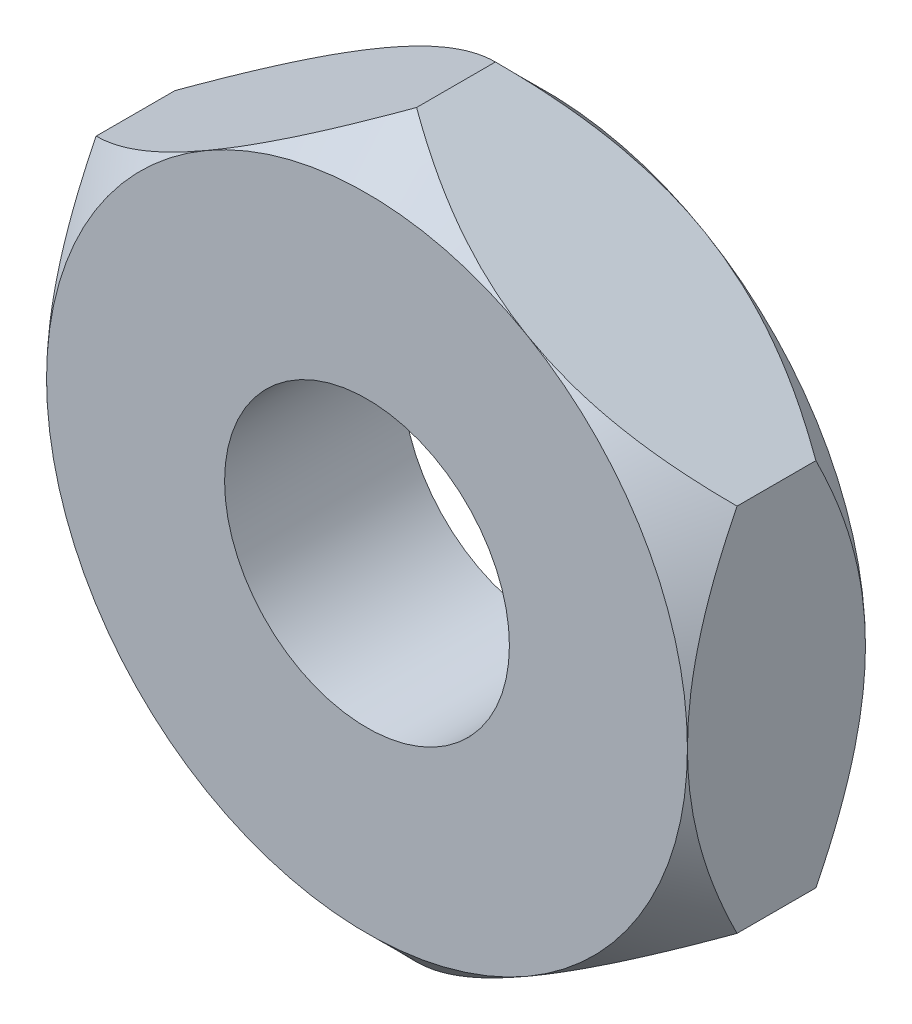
ISO-10303-21;
HEADER;
FILE_DESCRIPTION(('STEP AP214'),'2;1');
FILE_NAME('part.step','',(''),(''),'','','');
FILE_SCHEMA(('AUTOMOTIVE_DESIGN { 1 0 10303 214 1 1 1 1 }'));
ENDSEC;
DATA;
#1=APPLICATION_CONTEXT('core data for automotive mechanical design processes');
#2=APPLICATION_PROTOCOL_DEFINITION('international standard','automotive_design',2000,#1);
#3=PRODUCT_CONTEXT('',#1,'mechanical');
#4=PRODUCT('Part','Part','',(#3));
#5=PRODUCT_RELATED_PRODUCT_CATEGORY('part','',(#4));
#6=PRODUCT_DEFINITION_FORMATION('','',#4);
#7=PRODUCT_DEFINITION_CONTEXT('part definition',#1,'design');
#8=PRODUCT_DEFINITION('design','',#6,#7);
#9=PRODUCT_DEFINITION_SHAPE('','',#8);
#10=(LENGTH_UNIT() NAMED_UNIT(*) SI_UNIT(.MILLI.,.METRE.));
#11=(NAMED_UNIT(*) PLANE_ANGLE_UNIT() SI_UNIT($,.RADIAN.));
#12=(NAMED_UNIT(*) SI_UNIT($,.STERADIAN.) SOLID_ANGLE_UNIT());
#13=UNCERTAINTY_MEASURE_WITH_UNIT(LENGTH_MEASURE(1.E-05),#10,'distance_accuracy_value','');
#14=(GEOMETRIC_REPRESENTATION_CONTEXT(3) GLOBAL_UNCERTAINTY_ASSIGNED_CONTEXT((#13)) GLOBAL_UNIT_ASSIGNED_CONTEXT((#10,
#11,#12)) REPRESENTATION_CONTEXT('',''));
#15=CARTESIAN_POINT('',(0.,0.,0.));
#16=DIRECTION('',(0.,0.,1.));
#17=DIRECTION('',(1.,0.,0.));
#18=AXIS2_PLACEMENT_3D('',#15,#16,#17);
#19=CARTESIAN_POINT('',(0.,10.3923048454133,5.));
#20=DIRECTION('',(0.5,-0.866025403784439,0.));
#21=DIRECTION('',(0.866025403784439,0.5,0.));
#22=AXIS2_PLACEMENT_3D('',#19,#20,#21);
#23=PLANE('',#22);
#24=DIRECTION('',(0.,0.,-1.));
#25=VECTOR('',#24,1.);
#26=CARTESIAN_POINT('',(0.,10.3923048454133,5.));
#27=LINE('',#26,#25);
#28=CARTESIAN_POINT('',(0.,10.3923048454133,3.60769515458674));
#29=VERTEX_POINT('',#28);
#30=CARTESIAN_POINT('',(0.,10.3923048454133,1.39230484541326));
#31=VERTEX_POINT('',#30);
#32=EDGE_CURVE('E194',#29,#31,#27,.T.);
#33=ORIENTED_EDGE('',*,*,#32,.T.);
#34=CARTESIAN_POINT('',(0.000200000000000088,10.3924203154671,1.39242031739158));
#35=CARTESIAN_POINT('',(-0.154531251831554,10.3030861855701,1.30309863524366));
#36=CARTESIAN_POINT('',(-0.310474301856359,10.21305242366,1.21650254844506));
#37=CARTESIAN_POINT('',(-0.624972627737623,10.0314767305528,1.04962736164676));
#38=CARTESIAN_POINT('',(-0.783529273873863,9.93993400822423,0.969351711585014));
#39=CARTESIAN_POINT('',(-1.10419129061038,9.75479970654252,0.815643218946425));
#40=CARTESIAN_POINT('',(-1.26631178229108,9.66119939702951,0.742252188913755));
#41=CARTESIAN_POINT('',(-1.59321555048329,9.47246141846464,0.603906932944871));
#42=CARTESIAN_POINT('',(-1.7579984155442,9.37732398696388,0.538951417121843));
#43=CARTESIAN_POINT('',(-2.08757746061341,9.18704143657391,0.419532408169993));
#44=CARTESIAN_POINT('',(-2.25233313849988,9.09191970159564,0.364920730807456));
#45=CARTESIAN_POINT('',(-2.58415409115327,8.90034278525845,0.266051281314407));
#46=CARTESIAN_POINT('',(-2.75121911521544,8.80388774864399,0.221792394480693));
#47=CARTESIAN_POINT('',(-3.08694416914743,8.61005679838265,0.144742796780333));
#48=CARTESIAN_POINT('',(-3.25559971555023,8.51268347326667,0.11192627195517));
#49=CARTESIAN_POINT('',(-3.59432673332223,8.3171193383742,0.0584825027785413));
#50=CARTESIAN_POINT('',(-3.76439798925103,8.2189286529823,0.0378534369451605));
#51=CARTESIAN_POINT('',(-4.17884614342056,7.97964689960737,0.00326438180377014));
#52=CARTESIAN_POINT('',(-4.42367100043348,7.83829720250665,-0.00399417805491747));
#53=CARTESIAN_POINT('',(-4.91287794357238,7.55585344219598,0.00818869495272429));
#54=CARTESIAN_POINT('',(-5.15725984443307,7.41475948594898,0.0276394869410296));
#55=CARTESIAN_POINT('',(-5.64371998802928,7.13390159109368,0.0920929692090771));
#56=CARTESIAN_POINT('',(-5.88579534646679,6.99413931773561,0.137124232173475));
#57=CARTESIAN_POINT('',(-6.36578525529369,6.7170170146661,0.25029089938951));
#58=CARTESIAN_POINT('',(-6.60370012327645,6.57965680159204,0.318424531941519));
#59=CARTESIAN_POINT('',(-7.02603245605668,6.33582311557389,0.458593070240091));
#60=CARTESIAN_POINT('',(-7.21138526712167,6.22880962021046,0.526940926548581));
#61=CARTESIAN_POINT('',(-7.57876374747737,6.01670355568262,0.674650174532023));
#62=CARTESIAN_POINT('',(-7.76078931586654,5.91161104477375,0.754011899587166));
#63=CARTESIAN_POINT('',(-8.12093998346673,5.70367795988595,0.921970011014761));
#64=CARTESIAN_POINT('',(-8.29907532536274,5.6008314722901,1.01053735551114));
#65=CARTESIAN_POINT('',(-8.65204760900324,5.39704282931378,1.19574403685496));
#66=CARTESIAN_POINT('',(-8.82688649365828,5.29609955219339,1.2923784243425));
#67=CARTESIAN_POINT('',(-9.0002,5.19603695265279,1.39242031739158));
#68=B_SPLINE_CURVE_WITH_KNOTS('',3,(#34,#35,#36,#37,#38,#39,#40,#41,#42,#43,#44,#45,#46,#47,#48,
#49,#50,#51,#52,#53,#54,#55,#56,#57,#58,#59,#60,#61,#62,#63,#64,#65,#66,#67),.UNSPECIFIED.,.F.,
.F.,(4,2,2,2,2,2,2,2,2,2,2,2,2,2,2,2,4),(0.,0.59928023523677,1.19888534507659,1.80192368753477,
2.40486970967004,2.99838724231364,3.59184084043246,4.18394681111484,4.77596426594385,
5.62301971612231,6.47037205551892,7.31867273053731,8.16690836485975,8.84061799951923,
9.5143480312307,10.1860136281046,10.8572701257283),.UNSPECIFIED.);
#69=CARTESIAN_POINT('',(-4.5,7.79422863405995,0.));
#70=VERTEX_POINT('',#69);
#71=EDGE_CURVE('E47',#31,#70,#68,.T.);
#72=ORIENTED_EDGE('',*,*,#71,.T.);
#73=CARTESIAN_POINT('',(-9.,5.19615242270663,1.39230484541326));
#74=VERTEX_POINT('',#73);
#75=EDGE_CURVE('E142',#70,#74,#68,.T.);
#76=ORIENTED_EDGE('',*,*,#75,.T.);
#77=DIRECTION('',(0.,0.,-1.));
#78=VECTOR('',#77,1.);
#79=CARTESIAN_POINT('',(-9.,5.19615242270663,5.));
#80=LINE('',#79,#78);
#81=CARTESIAN_POINT('',(-9.,5.19615242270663,3.60769515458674));
#82=VERTEX_POINT('',#81);
#83=EDGE_CURVE('E153',#82,#74,#80,.T.);
#84=ORIENTED_EDGE('',*,*,#83,.F.);
#85=CARTESIAN_POINT('',(0.0002,10.3924203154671,3.60757968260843));
#86=CARTESIAN_POINT('',(-0.154531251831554,10.3030861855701,3.69690136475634));
#87=CARTESIAN_POINT('',(-0.310474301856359,10.21305242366,3.78349745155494));
#88=CARTESIAN_POINT('',(-0.624972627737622,10.0314767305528,3.95037263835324));
#89=CARTESIAN_POINT('',(-0.783529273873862,9.93993400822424,4.03064828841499));
#90=CARTESIAN_POINT('',(-1.10419129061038,9.75479970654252,4.18435678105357));
#91=CARTESIAN_POINT('',(-1.26631178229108,9.66119939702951,4.25774781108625));
#92=CARTESIAN_POINT('',(-1.59321555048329,9.47246141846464,4.39609306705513));
#93=CARTESIAN_POINT('',(-1.7579984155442,9.37732398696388,4.46104858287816));
#94=CARTESIAN_POINT('',(-2.08757746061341,9.18704143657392,4.58046759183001));
#95=CARTESIAN_POINT('',(-2.25233313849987,9.09191970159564,4.63507926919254));
#96=CARTESIAN_POINT('',(-2.58415409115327,8.90034278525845,4.73394871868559));
#97=CARTESIAN_POINT('',(-2.75121911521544,8.80388774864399,4.77820760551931));
#98=CARTESIAN_POINT('',(-3.08694416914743,8.61005679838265,4.85525720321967));
#99=CARTESIAN_POINT('',(-3.25559971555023,8.51268347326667,4.88807372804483));
#100=CARTESIAN_POINT('',(-3.59432673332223,8.3171193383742,4.94151749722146));
#101=CARTESIAN_POINT('',(-3.76439798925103,8.2189286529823,4.96214656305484));
#102=CARTESIAN_POINT('',(-4.17884614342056,7.97964689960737,4.99673561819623));
#103=CARTESIAN_POINT('',(-4.42367100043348,7.83829720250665,5.00399417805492));
#104=CARTESIAN_POINT('',(-4.91287794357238,7.55585344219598,4.99181130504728));
#105=CARTESIAN_POINT('',(-5.15725984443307,7.41475948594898,4.97236051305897));
#106=CARTESIAN_POINT('',(-5.64371998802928,7.13390159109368,4.90790703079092));
#107=CARTESIAN_POINT('',(-5.8857953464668,6.99413931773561,4.86287576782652));
#108=CARTESIAN_POINT('',(-6.36578525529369,6.7170170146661,4.74970910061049));
#109=CARTESIAN_POINT('',(-6.60370012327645,6.57965680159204,4.68157546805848));
#110=CARTESIAN_POINT('',(-7.02603245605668,6.33582311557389,4.54140692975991));
#111=CARTESIAN_POINT('',(-7.21138526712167,6.22880962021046,4.47305907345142));
#112=CARTESIAN_POINT('',(-7.57876374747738,6.01670355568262,4.32534982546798));
#113=CARTESIAN_POINT('',(-7.76078931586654,5.91161104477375,4.24598810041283));
#114=CARTESIAN_POINT('',(-8.12093998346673,5.70367795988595,4.07802998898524));
#115=CARTESIAN_POINT('',(-8.29907532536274,5.6008314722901,3.98946264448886));
#116=CARTESIAN_POINT('',(-8.65204760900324,5.39704282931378,3.80425596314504));
#117=CARTESIAN_POINT('',(-8.82688649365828,5.29609955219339,3.7076215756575));
#118=CARTESIAN_POINT('',(-9.0002,5.19603695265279,3.60757968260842));
#119=B_SPLINE_CURVE_WITH_KNOTS('',3,(#85,#86,#87,#88,#89,#90,#91,#92,#93,#94,#95,#96,#97,#98,
#99,#100,#101,#102,#103,#104,#105,#106,#107,#108,#109,#110,#111,#112,#113,#114,#115,#116,#117,
#118),.UNSPECIFIED.,.F.,.F.,(4,2,2,2,2,2,2,2,2,2,2,2,2,2,2,2,4),(0.,0.599280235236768,
1.19888534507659,1.80192368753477,2.40486970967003,2.99838724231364,3.59184084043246,
4.18394681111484,4.77596426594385,5.62301971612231,6.47037205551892,7.31867273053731,
8.16690836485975,8.84061799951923,9.5143480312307,10.1860136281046,10.8572701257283),.UNSPECIFIED.);
#120=CARTESIAN_POINT('',(-4.5,7.79422863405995,5.));
#121=VERTEX_POINT('',#120);
#122=EDGE_CURVE('E231',#121,#82,#119,.T.);
#123=ORIENTED_EDGE('',*,*,#122,.F.);
#124=EDGE_CURVE('E222',#29,#121,#119,.T.);
#125=ORIENTED_EDGE('',*,*,#124,.F.);
#126=EDGE_LOOP('',(#33,#72,#76,#84,#123,#125));
#127=FACE_BOUND('',#126,.T.);
#128=ADVANCED_FACE('F31',(#127),#23,.F.);
#129=CARTESIAN_POINT('',(-9.,5.19615242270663,5.));
#130=DIRECTION('',(1.,0.,0.));
#131=DIRECTION('',(0.,0.,-1.));
#132=AXIS2_PLACEMENT_3D('',#129,#130,#131);
#133=PLANE('',#132);
#134=ORIENTED_EDGE('',*,*,#83,.T.);
#135=CARTESIAN_POINT('',(-9.,-12.8170177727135,6.66128808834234));
#136=CARTESIAN_POINT('',(-9.,-12.6556764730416,6.5292506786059));
#137=CARTESIAN_POINT('',(-9.,-12.4939343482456,6.39770328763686));
#138=CARTESIAN_POINT('',(-9.,-12.1695689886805,6.13569476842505));
#139=CARTESIAN_POINT('',(-9.,-12.006945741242,6.00523365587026));
#140=CARTESIAN_POINT('',(-9.,-11.5175629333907,5.61558172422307));
#141=CARTESIAN_POINT('',(-9.,-11.1893685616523,5.35818651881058));
#142=CARTESIAN_POINT('',(-9.,-10.5248001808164,4.84651376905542));
#143=CARTESIAN_POINT('',(-9.,-10.1883759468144,4.59230130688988));
#144=CARTESIAN_POINT('',(-9.,-9.50994940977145,4.09147694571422));
#145=CARTESIAN_POINT('',(-9.,-9.16794764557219,3.84486431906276));
#146=CARTESIAN_POINT('',(-9.,-8.44539988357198,3.3390487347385));
#147=CARTESIAN_POINT('',(-9.,-8.06420119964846,3.08077302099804));
#148=CARTESIAN_POINT('',(-9.,-7.29169422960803,2.57939444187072));
#149=CARTESIAN_POINT('',(-9.,-6.90038274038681,2.3362964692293));
#150=CARTESIAN_POINT('',(-9.,-6.10738508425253,1.87185569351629));
#151=CARTESIAN_POINT('',(-9.,-5.70575513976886,1.6504176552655));
#152=CARTESIAN_POINT('',(-9.,-4.88825371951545,1.23577451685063));
#153=CARTESIAN_POINT('',(-9.,-4.47239481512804,1.04254525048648));
#154=CARTESIAN_POINT('',(-9.,-3.896840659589,0.80644131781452));
#155=CARTESIAN_POINT('',(-9.,-3.74403623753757,0.746662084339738));
#156=CARTESIAN_POINT('',(-9.,-3.43637130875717,0.632663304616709));
#157=CARTESIAN_POINT('',(-9.,-3.28151082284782,0.578443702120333));
#158=CARTESIAN_POINT('',(-9.,-2.81381366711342,0.425013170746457));
#159=CARTESIAN_POINT('',(-9.,-2.49785491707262,0.335027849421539));
#160=CARTESIAN_POINT('',(-9.,-1.865913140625,0.186376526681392));
#161=CARTESIAN_POINT('',(-9.,-1.55008422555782,0.127063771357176));
#162=CARTESIAN_POINT('',(-9.,-0.913999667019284,0.0408119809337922));
#163=CARTESIAN_POINT('',(-9.,-0.593745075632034,0.0138653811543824));
#164=CARTESIAN_POINT('',(-9.,0.0314838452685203,-0.00509320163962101));
#165=CARTESIAN_POINT('',(-9.,0.336406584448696,0.00118713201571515));
#166=CARTESIAN_POINT('',(-9.,0.944065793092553,0.0443001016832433));
#167=CARTESIAN_POINT('',(-9.,1.24680210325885,0.0811349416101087));
#168=CARTESIAN_POINT('',(-9.,1.85317845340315,0.183854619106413));
#169=CARTESIAN_POINT('',(-9.,2.15672497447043,0.250281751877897));
#170=CARTESIAN_POINT('',(-9.,2.75705283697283,0.408368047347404));
#171=CARTESIAN_POINT('',(-9.,3.05383433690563,0.500026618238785));
#172=CARTESIAN_POINT('',(-9.,3.64862676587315,0.707339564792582));
#173=CARTESIAN_POINT('',(-9.,3.94641622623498,0.823621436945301));
#174=CARTESIAN_POINT('',(-9.,4.53437749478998,1.0742141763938));
#175=CARTESIAN_POINT('',(-9.,4.82454588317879,1.20853297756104));
#176=CARTESIAN_POINT('',(-9.,5.39860343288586,1.49201728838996));
#177=CARTESIAN_POINT('',(-9.,5.6824702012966,1.64122777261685));
#178=CARTESIAN_POINT('',(-9.,6.24371514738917,1.95122222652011));
#179=CARTESIAN_POINT('',(-9.,6.52109429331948,2.11200445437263));
#180=CARTESIAN_POINT('',(-9.,7.05662646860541,2.43471108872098));
#181=CARTESIAN_POINT('',(-9.,7.31505192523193,2.59618579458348));
#182=CARTESIAN_POINT('',(-9.,7.82746233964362,2.92605343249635));
#183=CARTESIAN_POINT('',(-9.,8.08144696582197,3.09444687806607));
#184=CARTESIAN_POINT('',(-9.,8.58352913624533,3.43556387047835));
#185=CARTESIAN_POINT('',(-9.,8.83165744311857,3.60824230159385));
#186=CARTESIAN_POINT('',(-9.,9.32450364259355,3.95826283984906));
#187=CARTESIAN_POINT('',(-9.,9.56922245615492,4.13560364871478));
#188=CARTESIAN_POINT('',(-9.,9.81250952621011,4.31485423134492));
#189=B_SPLINE_CURVE_WITH_KNOTS('',3,(#135,#136,#137,#138,#139,#140,#141,#142,#143,#144,#145,
#146,#147,#148,#149,#150,#151,#152,#153,#154,#155,#156,#157,#158,#159,#160,#161,#162,#163,#164,
#165,#166,#167,#168,#169,#170,#171,#172,#173,#174,#175,#176,#177,#178,#179,#180,#181,#182,#183,
#184,#185,#186,#187,#188),.UNSPECIFIED.,.F.,.F.,(4,2,2,2,2,2,2,2,2,2,2,2,2,2,2,2,2,2,2,2,2,2,2,
2,2,2,4),(0.,0.625445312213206,1.25089964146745,2.5021119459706,3.76703666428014,
5.03183989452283,6.41293652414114,7.79447609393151,9.16963896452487,10.5436167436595,
11.0357688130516,11.5279159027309,12.5121893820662,13.4747627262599,14.4371110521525,
15.3504960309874,16.2639468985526,17.194873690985,18.1257786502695,19.0841145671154,
20.0428734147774,21.0046208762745,21.9662238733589,22.880272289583,23.7943886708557,
24.7012314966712,25.6078244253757),.UNSPECIFIED.);
#190=CARTESIAN_POINT('',(-9.,0.,0.));
#191=VERTEX_POINT('',#190);
#192=EDGE_CURVE('E136',#74,#191,#189,.F.);
#193=ORIENTED_EDGE('',*,*,#192,.T.);
#194=CARTESIAN_POINT('',(-9.,-5.19615242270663,1.39230484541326));
#195=VERTEX_POINT('',#194);
#196=EDGE_CURVE('E124',#191,#195,#189,.F.);
#197=ORIENTED_EDGE('',*,*,#196,.T.);
#198=DIRECTION('',(0.,0.,-1.));
#199=VECTOR('',#198,1.);
#200=CARTESIAN_POINT('',(-9.,-5.19615242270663,5.));
#201=LINE('',#200,#199);
#202=CARTESIAN_POINT('',(-9.,-5.19615242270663,3.60769515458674));
#203=VERTEX_POINT('',#202);
#204=EDGE_CURVE('E304',#203,#195,#201,.T.);
#205=ORIENTED_EDGE('',*,*,#204,.F.);
#206=CARTESIAN_POINT('',(-9.,-12.8170177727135,-1.66128808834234));
#207=CARTESIAN_POINT('',(-9.,-12.6556764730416,-1.5292506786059));
#208=CARTESIAN_POINT('',(-9.,-12.4939343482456,-1.39770328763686));
#209=CARTESIAN_POINT('',(-9.,-12.1695689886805,-1.13569476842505));
#210=CARTESIAN_POINT('',(-9.,-12.006945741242,-1.00523365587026));
#211=CARTESIAN_POINT('',(-9.,-11.5175629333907,-0.615581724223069));
#212=CARTESIAN_POINT('',(-9.,-11.1893685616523,-0.358186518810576));
#213=CARTESIAN_POINT('',(-9.,-10.5248001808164,0.153486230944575));
#214=CARTESIAN_POINT('',(-9.,-10.1883759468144,0.407698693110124));
#215=CARTESIAN_POINT('',(-9.,-9.50994940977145,0.90852305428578));
#216=CARTESIAN_POINT('',(-9.,-9.16794764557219,1.15513568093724));
#217=CARTESIAN_POINT('',(-9.,-8.44539988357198,1.6609512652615));
#218=CARTESIAN_POINT('',(-9.,-8.06420119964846,1.91922697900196));
#219=CARTESIAN_POINT('',(-9.,-7.29169422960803,2.42060555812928));
#220=CARTESIAN_POINT('',(-9.,-6.90038274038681,2.6637035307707));
#221=CARTESIAN_POINT('',(-9.,-6.10738508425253,3.12814430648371));
#222=CARTESIAN_POINT('',(-9.,-5.70575513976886,3.34958234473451));
#223=CARTESIAN_POINT('',(-9.,-4.88825371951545,3.76422548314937));
#224=CARTESIAN_POINT('',(-9.,-4.47239481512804,3.95745474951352));
#225=CARTESIAN_POINT('',(-9.,-3.896840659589,4.19355868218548));
#226=CARTESIAN_POINT('',(-9.,-3.74403623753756,4.25333791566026));
#227=CARTESIAN_POINT('',(-9.,-3.43637130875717,4.36733669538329));
#228=CARTESIAN_POINT('',(-9.,-3.28151082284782,4.42155629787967));
#229=CARTESIAN_POINT('',(-9.,-2.81381366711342,4.57498682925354));
#230=CARTESIAN_POINT('',(-9.,-2.49785491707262,4.66497215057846));
#231=CARTESIAN_POINT('',(-9.,-1.865913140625,4.81362347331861));
#232=CARTESIAN_POINT('',(-9.,-1.55008422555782,4.87293622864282));
#233=CARTESIAN_POINT('',(-9.,-0.913999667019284,4.95918801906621));
#234=CARTESIAN_POINT('',(-9.,-0.593745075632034,4.98613461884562));
#235=CARTESIAN_POINT('',(-9.,0.0314838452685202,5.00509320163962));
#236=CARTESIAN_POINT('',(-9.,0.336406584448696,4.99881286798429));
#237=CARTESIAN_POINT('',(-9.,0.944065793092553,4.95569989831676));
#238=CARTESIAN_POINT('',(-9.,1.24680210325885,4.91886505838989));
#239=CARTESIAN_POINT('',(-9.,1.85317845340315,4.81614538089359));
#240=CARTESIAN_POINT('',(-9.,2.15672497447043,4.7497182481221));
#241=CARTESIAN_POINT('',(-9.,2.75705283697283,4.5916319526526));
#242=CARTESIAN_POINT('',(-9.,3.05383433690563,4.49997338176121));
#243=CARTESIAN_POINT('',(-9.,3.64862676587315,4.29266043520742));
#244=CARTESIAN_POINT('',(-9.,3.94641622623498,4.1763785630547));
#245=CARTESIAN_POINT('',(-9.,4.53437749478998,3.9257858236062));
#246=CARTESIAN_POINT('',(-9.,4.82454588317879,3.79146702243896));
#247=CARTESIAN_POINT('',(-9.,5.39860343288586,3.50798271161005));
#248=CARTESIAN_POINT('',(-9.,5.6824702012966,3.35877222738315));
#249=CARTESIAN_POINT('',(-9.,6.24371514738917,3.04877777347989));
#250=CARTESIAN_POINT('',(-9.,6.52109429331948,2.88799554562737));
#251=CARTESIAN_POINT('',(-9.,7.05662646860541,2.56528891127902));
#252=CARTESIAN_POINT('',(-9.,7.31505192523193,2.40381420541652));
#253=CARTESIAN_POINT('',(-9.,7.82746233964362,2.07394656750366));
#254=CARTESIAN_POINT('',(-9.,8.08144696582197,1.90555312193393));
#255=CARTESIAN_POINT('',(-9.,8.58352913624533,1.56443612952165));
#256=CARTESIAN_POINT('',(-9.,8.83165744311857,1.39175769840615));
#257=CARTESIAN_POINT('',(-9.,9.32450364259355,1.04173716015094));
#258=CARTESIAN_POINT('',(-9.,9.56922245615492,0.864396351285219));
#259=CARTESIAN_POINT('',(-9.,9.81250952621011,0.685145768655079));
#260=B_SPLINE_CURVE_WITH_KNOTS('',3,(#206,#207,#208,#209,#210,#211,#212,#213,#214,#215,#216,
#217,#218,#219,#220,#221,#222,#223,#224,#225,#226,#227,#228,#229,#230,#231,#232,#233,#234,#235,
#236,#237,#238,#239,#240,#241,#242,#243,#244,#245,#246,#247,#248,#249,#250,#251,#252,#253,#254,
#255,#256,#257,#258,#259),.UNSPECIFIED.,.F.,.F.,(4,2,2,2,2,2,2,2,2,2,2,2,2,2,2,2,2,2,2,2,2,2,2,
2,2,2,4),(0.,0.625445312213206,1.25089964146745,2.5021119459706,3.76703666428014,
5.03183989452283,6.41293652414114,7.79447609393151,9.16963896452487,10.5436167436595,
11.0357688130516,11.5279159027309,12.5121893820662,13.4747627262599,14.4371110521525,
15.3504960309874,16.2639468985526,17.194873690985,18.1257786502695,19.0841145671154,
20.0428734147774,21.0046208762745,21.9662238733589,22.880272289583,23.7943886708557,
24.7012314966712,25.6078244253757),.UNSPECIFIED.);
#261=CARTESIAN_POINT('',(-9.,0.,5.));
#262=VERTEX_POINT('',#261);
#263=EDGE_CURVE('E181',#262,#203,#260,.F.);
#264=ORIENTED_EDGE('',*,*,#263,.F.);
#265=EDGE_CURVE('E187',#82,#262,#260,.F.);
#266=ORIENTED_EDGE('',*,*,#265,.F.);
#267=EDGE_LOOP('',(#134,#193,#197,#205,#264,#266));
#268=FACE_BOUND('',#267,.T.);
#269=ADVANCED_FACE('F150',(#268),#133,.F.);
#270=CARTESIAN_POINT('',(-9.,-5.19615242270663,5.));
#271=DIRECTION('',(0.5,0.866025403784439,0.));
#272=DIRECTION('',(-0.866025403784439,0.5,0.));
#273=AXIS2_PLACEMENT_3D('',#270,#271,#272);
#274=PLANE('',#273);
#275=ORIENTED_EDGE('',*,*,#204,.T.);
#276=CARTESIAN_POINT('',(-9.0002,-5.19603695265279,1.39242031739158));
#277=CARTESIAN_POINT('',(-8.84546874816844,-5.28537108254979,1.30309863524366));
#278=CARTESIAN_POINT('',(-8.68952569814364,-5.37540484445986,1.21650254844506));
#279=CARTESIAN_POINT('',(-8.37502737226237,-5.5569805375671,1.04962736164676));
#280=CARTESIAN_POINT('',(-8.21647072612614,-5.64852325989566,0.969351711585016));
#281=CARTESIAN_POINT('',(-7.89580870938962,-5.83365756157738,0.815643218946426));
#282=CARTESIAN_POINT('',(-7.73368821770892,-5.92725787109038,0.742252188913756));
#283=CARTESIAN_POINT('',(-7.40678444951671,-6.11599584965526,0.603906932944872));
#284=CARTESIAN_POINT('',(-7.2420015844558,-6.21113328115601,0.538951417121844));
#285=CARTESIAN_POINT('',(-6.91242253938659,-6.40141583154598,0.419532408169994));
#286=CARTESIAN_POINT('',(-6.74766686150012,-6.49653756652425,0.364920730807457));
#287=CARTESIAN_POINT('',(-6.41584590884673,-6.68811448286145,0.266051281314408));
#288=CARTESIAN_POINT('',(-6.24878088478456,-6.78456951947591,0.221792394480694));
#289=CARTESIAN_POINT('',(-5.91305583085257,-6.97840046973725,0.144742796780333));
#290=CARTESIAN_POINT('',(-5.74440028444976,-7.07577379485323,0.111926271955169));
#291=CARTESIAN_POINT('',(-5.40567326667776,-7.27133792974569,0.0584825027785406));
#292=CARTESIAN_POINT('',(-5.23560201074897,-7.3695286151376,0.03785343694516));
#293=CARTESIAN_POINT('',(-4.82115385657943,-7.60881036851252,0.00326438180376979));
#294=CARTESIAN_POINT('',(-4.57632899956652,-7.75016006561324,-0.00399417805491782));
#295=CARTESIAN_POINT('',(-4.08712205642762,-8.03260382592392,0.00818869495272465));
#296=CARTESIAN_POINT('',(-3.84274015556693,-8.17369778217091,0.0276394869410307));
#297=CARTESIAN_POINT('',(-3.35628001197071,-8.45455567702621,0.0920929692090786));
#298=CARTESIAN_POINT('',(-3.1142046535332,-8.59431795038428,0.137124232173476));
#299=CARTESIAN_POINT('',(-2.63421474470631,-8.8714402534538,0.250290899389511));
#300=CARTESIAN_POINT('',(-2.39629987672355,-9.00880046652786,0.318424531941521));
#301=CARTESIAN_POINT('',(-1.97396754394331,-9.25263415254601,0.458593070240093));
#302=CARTESIAN_POINT('',(-1.78861473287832,-9.35964764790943,0.526940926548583));
#303=CARTESIAN_POINT('',(-1.42123625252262,-9.57175371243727,0.674650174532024));
#304=CARTESIAN_POINT('',(-1.23921068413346,-9.67684622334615,0.754011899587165));
#305=CARTESIAN_POINT('',(-0.879060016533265,-9.88477930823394,0.92197001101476));
#306=CARTESIAN_POINT('',(-0.700924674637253,-9.98762579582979,1.01053735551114));
#307=CARTESIAN_POINT('',(-0.347952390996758,-10.1914144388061,1.19574403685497));
#308=CARTESIAN_POINT('',(-0.173113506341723,-10.2923577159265,1.2923784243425));
#309=CARTESIAN_POINT('',(0.000200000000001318,-10.3924203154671,1.39242031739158));
#310=B_SPLINE_CURVE_WITH_KNOTS('',3,(#276,#277,#278,#279,#280,#281,#282,#283,#284,#285,#286,
#287,#288,#289,#290,#291,#292,#293,#294,#295,#296,#297,#298,#299,#300,#301,#302,#303,#304,#305,
#306,#307,#308,#309),.UNSPECIFIED.,.F.,.F.,(4,2,2,2,2,2,2,2,2,2,2,2,2,2,2,2,4),(0.,
0.59928023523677,1.19888534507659,1.80192368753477,2.40486970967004,2.99838724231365,
3.59184084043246,4.18394681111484,4.77596426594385,5.62301971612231,6.47037205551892,
7.31867273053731,8.16690836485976,8.84061799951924,9.51434803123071,10.1860136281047,
10.8572701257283),.UNSPECIFIED.);
#311=CARTESIAN_POINT('',(-4.5,-7.79422863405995,0.));
#312=VERTEX_POINT('',#311);
#313=EDGE_CURVE('E131',#195,#312,#310,.T.);
#314=ORIENTED_EDGE('',*,*,#313,.T.);
#315=CARTESIAN_POINT('',(0.,-10.3923048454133,1.39230484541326));
#316=VERTEX_POINT('',#315);
#317=EDGE_CURVE('E163',#312,#316,#310,.T.);
#318=ORIENTED_EDGE('',*,*,#317,.T.);
#319=DIRECTION('',(0.,0.,-1.));
#320=VECTOR('',#319,1.);
#321=CARTESIAN_POINT('',(0.,-10.3923048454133,5.));
#322=LINE('',#321,#320);
#323=CARTESIAN_POINT('',(0.,-10.3923048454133,3.60769515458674));
#324=VERTEX_POINT('',#323);
#325=EDGE_CURVE('E305',#324,#316,#322,.T.);
#326=ORIENTED_EDGE('',*,*,#325,.F.);
#327=CARTESIAN_POINT('',(-9.0002,-5.19603695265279,3.60757968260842));
#328=CARTESIAN_POINT('',(-8.84546874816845,-5.28537108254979,3.69690136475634));
#329=CARTESIAN_POINT('',(-8.68952569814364,-5.37540484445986,3.78349745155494));
#330=CARTESIAN_POINT('',(-8.37502737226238,-5.5569805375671,3.95037263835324));
#331=CARTESIAN_POINT('',(-8.21647072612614,-5.64852325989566,4.03064828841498));
#332=CARTESIAN_POINT('',(-7.89580870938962,-5.83365756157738,4.18435678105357));
#333=CARTESIAN_POINT('',(-7.73368821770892,-5.92725787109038,4.25774781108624));
#334=CARTESIAN_POINT('',(-7.40678444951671,-6.11599584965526,4.39609306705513));
#335=CARTESIAN_POINT('',(-7.2420015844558,-6.21113328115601,4.46104858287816));
#336=CARTESIAN_POINT('',(-6.91242253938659,-6.40141583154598,4.58046759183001));
#337=CARTESIAN_POINT('',(-6.74766686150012,-6.49653756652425,4.63507926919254));
#338=CARTESIAN_POINT('',(-6.41584590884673,-6.68811448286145,4.73394871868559));
#339=CARTESIAN_POINT('',(-6.24878088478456,-6.78456951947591,4.77820760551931));
#340=CARTESIAN_POINT('',(-5.91305583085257,-6.97840046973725,4.85525720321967));
#341=CARTESIAN_POINT('',(-5.74440028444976,-7.07577379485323,4.88807372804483));
#342=CARTESIAN_POINT('',(-5.40567326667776,-7.27133792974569,4.94151749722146));
#343=CARTESIAN_POINT('',(-5.23560201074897,-7.3695286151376,4.96214656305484));
#344=CARTESIAN_POINT('',(-4.82115385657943,-7.60881036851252,4.99673561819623));
#345=CARTESIAN_POINT('',(-4.57632899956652,-7.75016006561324,5.00399417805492));
#346=CARTESIAN_POINT('',(-4.08712205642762,-8.03260382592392,4.99181130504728));
#347=CARTESIAN_POINT('',(-3.84274015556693,-8.17369778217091,4.97236051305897));
#348=CARTESIAN_POINT('',(-3.35628001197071,-8.45455567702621,4.90790703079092));
#349=CARTESIAN_POINT('',(-3.1142046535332,-8.59431795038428,4.86287576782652));
#350=CARTESIAN_POINT('',(-2.63421474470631,-8.8714402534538,4.74970910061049));
#351=CARTESIAN_POINT('',(-2.39629987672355,-9.00880046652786,4.68157546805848));
#352=CARTESIAN_POINT('',(-1.97396754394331,-9.25263415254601,4.54140692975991));
#353=CARTESIAN_POINT('',(-1.78861473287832,-9.35964764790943,4.47305907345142));
#354=CARTESIAN_POINT('',(-1.42123625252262,-9.57175371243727,4.32534982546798));
#355=CARTESIAN_POINT('',(-1.23921068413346,-9.67684622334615,4.24598810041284));
#356=CARTESIAN_POINT('',(-0.879060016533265,-9.88477930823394,4.07802998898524));
#357=CARTESIAN_POINT('',(-0.700924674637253,-9.98762579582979,3.98946264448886));
#358=CARTESIAN_POINT('',(-0.347952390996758,-10.1914144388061,3.80425596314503));
#359=CARTESIAN_POINT('',(-0.173113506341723,-10.2923577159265,3.7076215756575));
#360=CARTESIAN_POINT('',(0.000200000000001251,-10.3924203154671,3.60757968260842));
#361=B_SPLINE_CURVE_WITH_KNOTS('',3,(#327,#328,#329,#330,#331,#332,#333,#334,#335,#336,#337,
#338,#339,#340,#341,#342,#343,#344,#345,#346,#347,#348,#349,#350,#351,#352,#353,#354,#355,#356,
#357,#358,#359,#360),.UNSPECIFIED.,.F.,.F.,(4,2,2,2,2,2,2,2,2,2,2,2,2,2,2,2,4),(0.,
0.599280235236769,1.19888534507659,1.80192368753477,2.40486970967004,2.99838724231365,
3.59184084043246,4.18394681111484,4.77596426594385,5.62301971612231,6.47037205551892,
7.31867273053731,8.16690836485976,8.84061799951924,9.51434803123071,10.1860136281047,
10.8572701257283),.UNSPECIFIED.);
#362=CARTESIAN_POINT('',(-4.5,-7.79422863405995,5.));
#363=VERTEX_POINT('',#362);
#364=EDGE_CURVE('E189',#363,#324,#361,.T.);
#365=ORIENTED_EDGE('',*,*,#364,.F.);
#366=EDGE_CURVE('E188',#203,#363,#361,.T.);
#367=ORIENTED_EDGE('',*,*,#366,.F.);
#368=EDGE_LOOP('',(#275,#314,#318,#326,#365,#367));
#369=FACE_BOUND('',#368,.T.);
#370=ADVANCED_FACE('F176',(#369),#274,.F.);
#371=CARTESIAN_POINT('',(9.,-5.19615242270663,5.));
#372=DIRECTION('',(0.5,-0.866025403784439,0.));
#373=DIRECTION('',(0.866025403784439,0.5,0.));
#374=AXIS2_PLACEMENT_3D('',#371,#372,#373);
#375=PLANE('',#374);
#376=CARTESIAN_POINT('',(9.0002,-5.19603695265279,1.39242031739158));
#377=CARTESIAN_POINT('',(8.84546874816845,-5.28537108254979,1.30309863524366));
#378=CARTESIAN_POINT('',(8.68952569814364,-5.37540484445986,1.21650254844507));
#379=CARTESIAN_POINT('',(8.37502737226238,-5.5569805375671,1.04962736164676));
#380=CARTESIAN_POINT('',(8.21647072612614,-5.64852325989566,0.969351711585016));
#381=CARTESIAN_POINT('',(7.89580870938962,-5.83365756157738,0.815643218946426));
#382=CARTESIAN_POINT('',(7.73368821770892,-5.92725787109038,0.742252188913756));
#383=CARTESIAN_POINT('',(7.40678444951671,-6.11599584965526,0.603906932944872));
#384=CARTESIAN_POINT('',(7.2420015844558,-6.21113328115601,0.538951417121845));
#385=CARTESIAN_POINT('',(6.91242253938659,-6.40141583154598,0.419532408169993));
#386=CARTESIAN_POINT('',(6.74766686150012,-6.49653756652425,0.364920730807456));
#387=CARTESIAN_POINT('',(6.41584590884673,-6.68811448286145,0.266051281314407));
#388=CARTESIAN_POINT('',(6.24878088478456,-6.78456951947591,0.221792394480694));
#389=CARTESIAN_POINT('',(5.91305583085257,-6.97840046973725,0.144742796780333));
#390=CARTESIAN_POINT('',(5.74440028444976,-7.07577379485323,0.11192627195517));
#391=CARTESIAN_POINT('',(5.40567326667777,-7.27133792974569,0.0584825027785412));
#392=CARTESIAN_POINT('',(5.23560201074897,-7.3695286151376,0.0378534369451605));
#393=CARTESIAN_POINT('',(4.82115385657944,-7.60881036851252,0.00326438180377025));
#394=CARTESIAN_POINT('',(4.57632899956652,-7.75016006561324,-0.00399417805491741));
#395=CARTESIAN_POINT('',(4.08712205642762,-8.03260382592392,0.00818869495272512));
#396=CARTESIAN_POINT('',(3.84274015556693,-8.17369778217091,0.0276394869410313));
#397=CARTESIAN_POINT('',(3.35628001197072,-8.45455567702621,0.0920929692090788));
#398=CARTESIAN_POINT('',(3.1142046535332,-8.59431795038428,0.137124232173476));
#399=CARTESIAN_POINT('',(2.63421474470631,-8.8714402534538,0.25029089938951));
#400=CARTESIAN_POINT('',(2.39629987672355,-9.00880046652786,0.31842453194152));
#401=CARTESIAN_POINT('',(1.97396754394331,-9.25263415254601,0.458593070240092));
#402=CARTESIAN_POINT('',(1.78861473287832,-9.35964764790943,0.526940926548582));
#403=CARTESIAN_POINT('',(1.42123625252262,-9.57175371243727,0.674650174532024));
#404=CARTESIAN_POINT('',(1.23921068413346,-9.67684622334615,0.754011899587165));
#405=CARTESIAN_POINT('',(0.879060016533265,-9.88477930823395,0.92197001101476));
#406=CARTESIAN_POINT('',(0.700924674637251,-9.98762579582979,1.01053735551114));
#407=CARTESIAN_POINT('',(0.347952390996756,-10.1914144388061,1.19574403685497));
#408=CARTESIAN_POINT('',(0.173113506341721,-10.2923577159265,1.2923784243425));
#409=CARTESIAN_POINT('',(-0.000200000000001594,-10.3924203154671,1.39242031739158));
#410=B_SPLINE_CURVE_WITH_KNOTS('',3,(#376,#377,#378,#379,#380,#381,#382,#383,#384,#385,#386,
#387,#388,#389,#390,#391,#392,#393,#394,#395,#396,#397,#398,#399,#400,#401,#402,#403,#404,#405,
#406,#407,#408,#409),.UNSPECIFIED.,.F.,.F.,(4,2,2,2,2,2,2,2,2,2,2,2,2,2,2,2,4),(0.,
0.599280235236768,1.19888534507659,1.80192368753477,2.40486970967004,2.99838724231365,
3.59184084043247,4.18394681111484,4.77596426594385,5.62301971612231,6.47037205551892,
7.31867273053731,8.16690836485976,8.84061799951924,9.51434803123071,10.1860136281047,
10.8572701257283),.UNSPECIFIED.);
#411=CARTESIAN_POINT('',(9.,-5.19615242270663,1.39230484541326));
#412=VERTEX_POINT('',#411);
#413=CARTESIAN_POINT('',(4.5,-7.79422863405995,0.));
#414=VERTEX_POINT('',#413);
#415=EDGE_CURVE('E240',#412,#414,#410,.T.);
#416=ORIENTED_EDGE('',*,*,#415,.F.);
#417=DIRECTION('',(0.,0.,-1.));
#418=VECTOR('',#417,1.);
#419=CARTESIAN_POINT('',(9.,-5.19615242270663,5.));
#420=LINE('',#419,#418);
#421=CARTESIAN_POINT('',(9.,-5.19615242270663,3.60769515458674));
#422=VERTEX_POINT('',#421);
#423=EDGE_CURVE('E309',#422,#412,#420,.T.);
#424=ORIENTED_EDGE('',*,*,#423,.F.);
#425=CARTESIAN_POINT('',(9.0002,-5.19603695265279,3.60757968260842));
#426=CARTESIAN_POINT('',(8.84546874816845,-5.28537108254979,3.69690136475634));
#427=CARTESIAN_POINT('',(8.68952569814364,-5.37540484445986,3.78349745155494));
#428=CARTESIAN_POINT('',(8.37502737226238,-5.5569805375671,3.95037263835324));
#429=CARTESIAN_POINT('',(8.21647072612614,-5.64852325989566,4.03064828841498));
#430=CARTESIAN_POINT('',(7.89580870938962,-5.83365756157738,4.18435678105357));
#431=CARTESIAN_POINT('',(7.73368821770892,-5.92725787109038,4.25774781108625));
#432=CARTESIAN_POINT('',(7.40678444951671,-6.11599584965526,4.39609306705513));
#433=CARTESIAN_POINT('',(7.2420015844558,-6.21113328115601,4.46104858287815));
#434=CARTESIAN_POINT('',(6.91242253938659,-6.40141583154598,4.58046759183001));
#435=CARTESIAN_POINT('',(6.74766686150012,-6.49653756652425,4.63507926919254));
#436=CARTESIAN_POINT('',(6.41584590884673,-6.68811448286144,4.73394871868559));
#437=CARTESIAN_POINT('',(6.24878088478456,-6.78456951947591,4.77820760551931));
#438=CARTESIAN_POINT('',(5.91305583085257,-6.97840046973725,4.85525720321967));
#439=CARTESIAN_POINT('',(5.74440028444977,-7.07577379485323,4.88807372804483));
#440=CARTESIAN_POINT('',(5.40567326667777,-7.27133792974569,4.94151749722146));
#441=CARTESIAN_POINT('',(5.23560201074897,-7.3695286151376,4.96214656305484));
#442=CARTESIAN_POINT('',(4.82115385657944,-7.60881036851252,4.99673561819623));
#443=CARTESIAN_POINT('',(4.57632899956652,-7.75016006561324,5.00399417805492));
#444=CARTESIAN_POINT('',(4.08712205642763,-8.03260382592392,4.99181130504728));
#445=CARTESIAN_POINT('',(3.84274015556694,-8.17369778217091,4.97236051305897));
#446=CARTESIAN_POINT('',(3.35628001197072,-8.45455567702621,4.90790703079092));
#447=CARTESIAN_POINT('',(3.11420465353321,-8.59431795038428,4.86287576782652));
#448=CARTESIAN_POINT('',(2.63421474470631,-8.87144025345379,4.74970910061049));
#449=CARTESIAN_POINT('',(2.39629987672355,-9.00880046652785,4.68157546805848));
#450=CARTESIAN_POINT('',(1.97396754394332,-9.252634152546,4.54140692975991));
#451=CARTESIAN_POINT('',(1.78861473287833,-9.35964764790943,4.47305907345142));
#452=CARTESIAN_POINT('',(1.42123625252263,-9.57175371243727,4.32534982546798));
#453=CARTESIAN_POINT('',(1.23921068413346,-9.67684622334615,4.24598810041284));
#454=CARTESIAN_POINT('',(0.879060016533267,-9.88477930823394,4.07802998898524));
#455=CARTESIAN_POINT('',(0.700924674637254,-9.98762579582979,3.98946264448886));
#456=CARTESIAN_POINT('',(0.347952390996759,-10.1914144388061,3.80425596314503));
#457=CARTESIAN_POINT('',(0.173113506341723,-10.2923577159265,3.7076215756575));
#458=CARTESIAN_POINT('',(-0.000200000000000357,-10.3924203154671,3.60757968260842));
#459=B_SPLINE_CURVE_WITH_KNOTS('',3,(#425,#426,#427,#428,#429,#430,#431,#432,#433,#434,#435,
#436,#437,#438,#439,#440,#441,#442,#443,#444,#445,#446,#447,#448,#449,#450,#451,#452,#453,#454,
#455,#456,#457,#458),.UNSPECIFIED.,.F.,.F.,(4,2,2,2,2,2,2,2,2,2,2,2,2,2,2,2,4),(0.,
0.599280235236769,1.19888534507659,1.80192368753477,2.40486970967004,2.99838724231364,
3.59184084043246,4.18394681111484,4.77596426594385,5.6230197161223,6.47037205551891,
7.31867273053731,8.16690836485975,8.84061799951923,9.5143480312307,10.1860136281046,
10.8572701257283),.UNSPECIFIED.);
#460=CARTESIAN_POINT('',(4.5,-7.79422863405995,5.));
#461=VERTEX_POINT('',#460);
#462=EDGE_CURVE('E226',#422,#461,#459,.T.);
#463=ORIENTED_EDGE('',*,*,#462,.T.);
#464=EDGE_CURVE('E233',#461,#324,#459,.T.);
#465=ORIENTED_EDGE('',*,*,#464,.T.);
#466=ORIENTED_EDGE('',*,*,#325,.T.);
#467=EDGE_CURVE('E55',#414,#316,#410,.T.);
#468=ORIENTED_EDGE('',*,*,#467,.F.);
#469=EDGE_LOOP('',(#416,#424,#463,#465,#466,#468));
#470=FACE_BOUND('',#469,.T.);
#471=ADVANCED_FACE('F234',(#470),#375,.T.);
#472=CARTESIAN_POINT('',(9.,5.19615242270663,5.));
#473=DIRECTION('',(1.,0.,0.));
#474=DIRECTION('',(0.,0.,-1.));
#475=AXIS2_PLACEMENT_3D('',#472,#473,#474);
#476=PLANE('',#475);
#477=CARTESIAN_POINT('',(9.,-12.8170177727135,6.66128808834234));
#478=CARTESIAN_POINT('',(9.,-12.6556764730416,6.5292506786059));
#479=CARTESIAN_POINT('',(9.,-12.4939343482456,6.39770328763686));
#480=CARTESIAN_POINT('',(9.,-12.1695689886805,6.13569476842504));
#481=CARTESIAN_POINT('',(9.,-12.006945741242,6.00523365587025));
#482=CARTESIAN_POINT('',(9.,-11.5175629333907,5.61558172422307));
#483=CARTESIAN_POINT('',(9.,-11.1893685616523,5.35818651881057));
#484=CARTESIAN_POINT('',(9.,-10.5248001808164,4.84651376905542));
#485=CARTESIAN_POINT('',(9.,-10.1883759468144,4.59230130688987));
#486=CARTESIAN_POINT('',(9.,-9.50994940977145,4.09147694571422));
#487=CARTESIAN_POINT('',(9.,-9.16794764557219,3.84486431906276));
#488=CARTESIAN_POINT('',(9.,-8.44539988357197,3.33904873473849));
#489=CARTESIAN_POINT('',(9.,-8.06420119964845,3.08077302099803));
#490=CARTESIAN_POINT('',(9.,-7.29169422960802,2.57939444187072));
#491=CARTESIAN_POINT('',(9.,-6.90038274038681,2.3362964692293));
#492=CARTESIAN_POINT('',(9.,-6.10738508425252,1.87185569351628));
#493=CARTESIAN_POINT('',(9.,-5.70575513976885,1.65041765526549));
#494=CARTESIAN_POINT('',(9.,-4.88825371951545,1.23577451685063));
#495=CARTESIAN_POINT('',(9.,-4.47239481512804,1.04254525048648));
#496=CARTESIAN_POINT('',(9.,-3.896840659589,0.80644131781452));
#497=CARTESIAN_POINT('',(9.,-3.74403623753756,0.746662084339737));
#498=CARTESIAN_POINT('',(9.,-3.43637130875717,0.632663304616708));
#499=CARTESIAN_POINT('',(9.,-3.28151082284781,0.578443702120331));
#500=CARTESIAN_POINT('',(9.,-2.81381366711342,0.425013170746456));
#501=CARTESIAN_POINT('',(9.,-2.49785491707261,0.335027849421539));
#502=CARTESIAN_POINT('',(9.,-1.865913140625,0.186376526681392));
#503=CARTESIAN_POINT('',(9.,-1.55008422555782,0.127063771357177));
#504=CARTESIAN_POINT('',(9.,-0.913999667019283,0.040811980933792));
#505=CARTESIAN_POINT('',(9.,-0.593745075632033,0.0138653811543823));
#506=CARTESIAN_POINT('',(9.,0.0314838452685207,-0.00509320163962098));
#507=CARTESIAN_POINT('',(9.,0.336406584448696,0.00118713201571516));
#508=CARTESIAN_POINT('',(9.,0.944065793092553,0.0443001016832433));
#509=CARTESIAN_POINT('',(9.,1.24680210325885,0.0811349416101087));
#510=CARTESIAN_POINT('',(9.,1.85317845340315,0.183854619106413));
#511=CARTESIAN_POINT('',(9.,2.15672497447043,0.250281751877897));
#512=CARTESIAN_POINT('',(9.,2.75705283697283,0.408368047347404));
#513=CARTESIAN_POINT('',(9.,3.05383433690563,0.500026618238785));
#514=CARTESIAN_POINT('',(9.,3.64862676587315,0.707339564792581));
#515=CARTESIAN_POINT('',(9.,3.94641622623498,0.8236214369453));
#516=CARTESIAN_POINT('',(9.,4.53437749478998,1.0742141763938));
#517=CARTESIAN_POINT('',(9.,4.82454588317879,1.20853297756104));
#518=CARTESIAN_POINT('',(9.,5.39860343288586,1.49201728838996));
#519=CARTESIAN_POINT('',(9.,5.68247020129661,1.64122777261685));
#520=CARTESIAN_POINT('',(9.,6.24371514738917,1.95122222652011));
#521=CARTESIAN_POINT('',(9.,6.52109429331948,2.11200445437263));
#522=CARTESIAN_POINT('',(9.,7.05662646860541,2.43471108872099));
#523=CARTESIAN_POINT('',(9.,7.31505192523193,2.59618579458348));
#524=CARTESIAN_POINT('',(9.,7.82746233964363,2.92605343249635));
#525=CARTESIAN_POINT('',(9.,8.08144696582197,3.09444687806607));
#526=CARTESIAN_POINT('',(9.,8.58352913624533,3.43556387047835));
#527=CARTESIAN_POINT('',(9.,8.83165744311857,3.60824230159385));
#528=CARTESIAN_POINT('',(9.,9.32450364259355,3.95826283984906));
#529=CARTESIAN_POINT('',(9.,9.56922245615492,4.13560364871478));
#530=CARTESIAN_POINT('',(9.,9.81250952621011,4.31485423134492));
#531=B_SPLINE_CURVE_WITH_KNOTS('',3,(#477,#478,#479,#480,#481,#482,#483,#484,#485,#486,#487,
#488,#489,#490,#491,#492,#493,#494,#495,#496,#497,#498,#499,#500,#501,#502,#503,#504,#505,#506,
#507,#508,#509,#510,#511,#512,#513,#514,#515,#516,#517,#518,#519,#520,#521,#522,#523,#524,#525,
#526,#527,#528,#529,#530),.UNSPECIFIED.,.F.,.F.,(4,2,2,2,2,2,2,2,2,2,2,2,2,2,2,2,2,2,2,2,2,2,2,
2,2,2,4),(0.,0.625445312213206,1.25089964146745,2.5021119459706,3.76703666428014,
5.03183989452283,6.41293652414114,7.7944760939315,9.16963896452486,10.5436167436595,
11.0357688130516,11.5279159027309,12.5121893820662,13.4747627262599,14.4371110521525,
15.3504960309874,16.2639468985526,17.194873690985,18.1257786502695,19.0841145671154,
20.0428734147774,21.0046208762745,21.9662238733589,22.880272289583,23.7943886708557,
24.7012314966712,25.6078244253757),.UNSPECIFIED.);
#532=CARTESIAN_POINT('',(9.,5.19615242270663,1.39230484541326));
#533=VERTEX_POINT('',#532);
#534=CARTESIAN_POINT('',(9.,0.,0.));
#535=VERTEX_POINT('',#534);
#536=EDGE_CURVE('E250',#533,#535,#531,.F.);
#537=ORIENTED_EDGE('',*,*,#536,.F.);
#538=DIRECTION('',(0.,0.,-1.));
#539=VECTOR('',#538,1.);
#540=CARTESIAN_POINT('',(9.,5.19615242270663,5.));
#541=LINE('',#540,#539);
#542=CARTESIAN_POINT('',(9.,5.19615242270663,3.60769515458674));
#543=VERTEX_POINT('',#542);
#544=EDGE_CURVE('E287',#543,#533,#541,.T.);
#545=ORIENTED_EDGE('',*,*,#544,.F.);
#546=CARTESIAN_POINT('',(9.,-12.8170177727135,-1.66128808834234));
#547=CARTESIAN_POINT('',(9.,-12.6556764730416,-1.5292506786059));
#548=CARTESIAN_POINT('',(9.,-12.4939343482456,-1.39770328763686));
#549=CARTESIAN_POINT('',(9.,-12.1695689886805,-1.13569476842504));
#550=CARTESIAN_POINT('',(9.,-12.006945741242,-1.00523365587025));
#551=CARTESIAN_POINT('',(9.,-11.5175629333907,-0.615581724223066));
#552=CARTESIAN_POINT('',(9.,-11.1893685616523,-0.358186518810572));
#553=CARTESIAN_POINT('',(9.,-10.5248001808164,0.15348623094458));
#554=CARTESIAN_POINT('',(9.,-10.1883759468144,0.407698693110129));
#555=CARTESIAN_POINT('',(9.,-9.50994940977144,0.908523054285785));
#556=CARTESIAN_POINT('',(9.,-9.16794764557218,1.15513568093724));
#557=CARTESIAN_POINT('',(9.,-8.44539988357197,1.66095126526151));
#558=CARTESIAN_POINT('',(9.,-8.06420119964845,1.91922697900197));
#559=CARTESIAN_POINT('',(9.,-7.29169422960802,2.42060555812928));
#560=CARTESIAN_POINT('',(9.,-6.90038274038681,2.6637035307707));
#561=CARTESIAN_POINT('',(9.,-6.10738508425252,3.12814430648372));
#562=CARTESIAN_POINT('',(9.,-5.70575513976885,3.34958234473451));
#563=CARTESIAN_POINT('',(9.,-4.88825371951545,3.76422548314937));
#564=CARTESIAN_POINT('',(9.,-4.47239481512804,3.95745474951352));
#565=CARTESIAN_POINT('',(9.,-3.896840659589,4.19355868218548));
#566=CARTESIAN_POINT('',(9.,-3.74403623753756,4.25333791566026));
#567=CARTESIAN_POINT('',(9.,-3.43637130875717,4.36733669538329));
#568=CARTESIAN_POINT('',(9.,-3.28151082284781,4.42155629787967));
#569=CARTESIAN_POINT('',(9.,-2.81381366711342,4.57498682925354));
#570=CARTESIAN_POINT('',(9.,-2.49785491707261,4.66497215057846));
#571=CARTESIAN_POINT('',(9.,-1.865913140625,4.81362347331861));
#572=CARTESIAN_POINT('',(9.,-1.55008422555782,4.87293622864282));
#573=CARTESIAN_POINT('',(9.,-0.913999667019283,4.95918801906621));
#574=CARTESIAN_POINT('',(9.,-0.593745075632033,4.98613461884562));
#575=CARTESIAN_POINT('',(9.,0.0314838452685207,5.00509320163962));
#576=CARTESIAN_POINT('',(9.,0.336406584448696,4.99881286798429));
#577=CARTESIAN_POINT('',(9.,0.944065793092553,4.95569989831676));
#578=CARTESIAN_POINT('',(9.,1.24680210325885,4.91886505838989));
#579=CARTESIAN_POINT('',(9.,1.85317845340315,4.81614538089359));
#580=CARTESIAN_POINT('',(9.,2.15672497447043,4.7497182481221));
#581=CARTESIAN_POINT('',(9.,2.75705283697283,4.5916319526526));
#582=CARTESIAN_POINT('',(9.,3.05383433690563,4.49997338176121));
#583=CARTESIAN_POINT('',(9.,3.64862676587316,4.29266043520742));
#584=CARTESIAN_POINT('',(9.,3.94641622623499,4.1763785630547));
#585=CARTESIAN_POINT('',(9.,4.53437749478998,3.92578582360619));
#586=CARTESIAN_POINT('',(9.,4.82454588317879,3.79146702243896));
#587=CARTESIAN_POINT('',(9.,5.39860343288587,3.50798271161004));
#588=CARTESIAN_POINT('',(9.,5.68247020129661,3.35877222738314));
#589=CARTESIAN_POINT('',(9.,6.24371514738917,3.04877777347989));
#590=CARTESIAN_POINT('',(9.,6.52109429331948,2.88799554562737));
#591=CARTESIAN_POINT('',(9.,7.05662646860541,2.56528891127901));
#592=CARTESIAN_POINT('',(9.,7.31505192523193,2.40381420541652));
#593=CARTESIAN_POINT('',(9.,7.82746233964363,2.07394656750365));
#594=CARTESIAN_POINT('',(9.,8.08144696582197,1.90555312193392));
#595=CARTESIAN_POINT('',(9.,8.58352913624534,1.56443612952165));
#596=CARTESIAN_POINT('',(9.,8.83165744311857,1.39175769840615));
#597=CARTESIAN_POINT('',(9.,9.32450364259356,1.04173716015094));
#598=CARTESIAN_POINT('',(9.,9.56922245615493,0.864396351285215));
#599=CARTESIAN_POINT('',(9.,9.81250952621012,0.685145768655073));
#600=B_SPLINE_CURVE_WITH_KNOTS('',3,(#546,#547,#548,#549,#550,#551,#552,#553,#554,#555,#556,
#557,#558,#559,#560,#561,#562,#563,#564,#565,#566,#567,#568,#569,#570,#571,#572,#573,#574,#575,
#576,#577,#578,#579,#580,#581,#582,#583,#584,#585,#586,#587,#588,#589,#590,#591,#592,#593,#594,
#595,#596,#597,#598,#599),.UNSPECIFIED.,.F.,.F.,(4,2,2,2,2,2,2,2,2,2,2,2,2,2,2,2,2,2,2,2,2,2,2,
2,2,2,4),(0.,0.625445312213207,1.25089964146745,2.5021119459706,3.76703666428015,
5.03183989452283,6.41293652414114,7.79447609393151,9.16963896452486,10.5436167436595,
11.0357688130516,11.5279159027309,12.5121893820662,13.4747627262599,14.4371110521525,
15.3504960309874,16.2639468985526,17.194873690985,18.1257786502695,19.0841145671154,
20.0428734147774,21.0046208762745,21.9662238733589,22.880272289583,23.7943886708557,
24.7012314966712,25.6078244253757),.UNSPECIFIED.);
#601=CARTESIAN_POINT('',(9.,0.,5.));
#602=VERTEX_POINT('',#601);
#603=EDGE_CURVE('E215',#543,#602,#600,.F.);
#604=ORIENTED_EDGE('',*,*,#603,.T.);
#605=EDGE_CURVE('E232',#602,#422,#600,.F.);
#606=ORIENTED_EDGE('',*,*,#605,.T.);
#607=ORIENTED_EDGE('',*,*,#423,.T.);
#608=EDGE_CURVE('E245',#535,#412,#531,.F.);
#609=ORIENTED_EDGE('',*,*,#608,.F.);
#610=EDGE_LOOP('',(#537,#545,#604,#606,#607,#609));
#611=FACE_BOUND('',#610,.T.);
#612=ADVANCED_FACE('F237',(#611),#476,.T.);
#613=CARTESIAN_POINT('',(0.,10.3923048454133,5.));
#614=DIRECTION('',(0.5,0.866025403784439,0.));
#615=DIRECTION('',(-0.866025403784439,0.5,0.));
#616=AXIS2_PLACEMENT_3D('',#613,#614,#615);
#617=PLANE('',#616);
#618=CARTESIAN_POINT('',(-0.000200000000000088,10.3924203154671,1.39242031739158));
#619=CARTESIAN_POINT('',(0.154531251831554,10.3030861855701,1.30309863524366));
#620=CARTESIAN_POINT('',(0.310474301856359,10.21305242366,1.21650254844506));
#621=CARTESIAN_POINT('',(0.624972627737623,10.0314767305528,1.04962736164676));
#622=CARTESIAN_POINT('',(0.783529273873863,9.93993400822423,0.969351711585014));
#623=CARTESIAN_POINT('',(1.10419129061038,9.75479970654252,0.815643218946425));
#624=CARTESIAN_POINT('',(1.26631178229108,9.66119939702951,0.742252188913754));
#625=CARTESIAN_POINT('',(1.59321555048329,9.47246141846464,0.603906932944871));
#626=CARTESIAN_POINT('',(1.7579984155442,9.37732398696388,0.538951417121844));
#627=CARTESIAN_POINT('',(2.08757746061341,9.18704143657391,0.419532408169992));
#628=CARTESIAN_POINT('',(2.25233313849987,9.09191970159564,0.364920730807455));
#629=CARTESIAN_POINT('',(2.58415409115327,8.90034278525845,0.266051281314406));
#630=CARTESIAN_POINT('',(2.75121911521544,8.80388774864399,0.221792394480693));
#631=CARTESIAN_POINT('',(3.08694416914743,8.61005679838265,0.144742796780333));
#632=CARTESIAN_POINT('',(3.25559971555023,8.51268347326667,0.111926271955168));
#633=CARTESIAN_POINT('',(3.59432673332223,8.3171193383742,0.0584825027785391));
#634=CARTESIAN_POINT('',(3.76439798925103,8.2189286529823,0.0378534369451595));
#635=CARTESIAN_POINT('',(4.17884614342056,7.97964689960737,0.00326438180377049));
#636=CARTESIAN_POINT('',(4.42367100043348,7.83829720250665,-0.00399417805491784));
#637=CARTESIAN_POINT('',(4.91287794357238,7.55585344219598,0.0081886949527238));
#638=CARTESIAN_POINT('',(5.15725984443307,7.41475948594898,0.0276394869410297));
#639=CARTESIAN_POINT('',(5.64371998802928,7.13390159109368,0.0920929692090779));
#640=CARTESIAN_POINT('',(5.8857953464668,6.99413931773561,0.137124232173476));
#641=CARTESIAN_POINT('',(6.36578525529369,6.7170170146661,0.25029089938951));
#642=CARTESIAN_POINT('',(6.60370012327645,6.57965680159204,0.318424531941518));
#643=CARTESIAN_POINT('',(7.02603245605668,6.33582311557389,0.458593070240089));
#644=CARTESIAN_POINT('',(7.21138526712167,6.22880962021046,0.52694092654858));
#645=CARTESIAN_POINT('',(7.57876374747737,6.01670355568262,0.674650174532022));
#646=CARTESIAN_POINT('',(7.76078931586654,5.91161104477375,0.754011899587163));
#647=CARTESIAN_POINT('',(8.12093998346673,5.70367795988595,0.921970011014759));
#648=CARTESIAN_POINT('',(8.29907532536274,5.6008314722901,1.01053735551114));
#649=CARTESIAN_POINT('',(8.65204760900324,5.39704282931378,1.19574403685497));
#650=CARTESIAN_POINT('',(8.82688649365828,5.29609955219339,1.2923784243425));
#651=CARTESIAN_POINT('',(9.0002,5.19603695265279,1.39242031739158));
#652=B_SPLINE_CURVE_WITH_KNOTS('',3,(#618,#619,#620,#621,#622,#623,#624,#625,#626,#627,#628,
#629,#630,#631,#632,#633,#634,#635,#636,#637,#638,#639,#640,#641,#642,#643,#644,#645,#646,#647,
#648,#649,#650,#651),.UNSPECIFIED.,.F.,.F.,(4,2,2,2,2,2,2,2,2,2,2,2,2,2,2,2,4),(0.,
0.59928023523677,1.19888534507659,1.80192368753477,2.40486970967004,2.99838724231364,
3.59184084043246,4.18394681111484,4.77596426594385,5.62301971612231,6.47037205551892,
7.31867273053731,8.16690836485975,8.84061799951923,9.5143480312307,10.1860136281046,
10.8572701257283),.UNSPECIFIED.);
#653=CARTESIAN_POINT('',(4.5,7.79422863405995,0.));
#654=VERTEX_POINT('',#653);
#655=EDGE_CURVE('E256',#31,#654,#652,.T.);
#656=ORIENTED_EDGE('',*,*,#655,.F.);
#657=ORIENTED_EDGE('',*,*,#32,.F.);
#658=CARTESIAN_POINT('',(-0.0002,10.3924203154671,3.60757968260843));
#659=CARTESIAN_POINT('',(0.154531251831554,10.3030861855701,3.69690136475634));
#660=CARTESIAN_POINT('',(0.310474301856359,10.21305242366,3.78349745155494));
#661=CARTESIAN_POINT('',(0.624972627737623,10.0314767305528,3.95037263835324));
#662=CARTESIAN_POINT('',(0.783529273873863,9.93993400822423,4.03064828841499));
#663=CARTESIAN_POINT('',(1.10419129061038,9.75479970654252,4.18435678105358));
#664=CARTESIAN_POINT('',(1.26631178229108,9.66119939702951,4.25774781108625));
#665=CARTESIAN_POINT('',(1.59321555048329,9.47246141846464,4.39609306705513));
#666=CARTESIAN_POINT('',(1.7579984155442,9.37732398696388,4.46104858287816));
#667=CARTESIAN_POINT('',(2.08757746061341,9.18704143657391,4.58046759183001));
#668=CARTESIAN_POINT('',(2.25233313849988,9.09191970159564,4.63507926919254));
#669=CARTESIAN_POINT('',(2.58415409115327,8.90034278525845,4.73394871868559));
#670=CARTESIAN_POINT('',(2.75121911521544,8.80388774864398,4.77820760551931));
#671=CARTESIAN_POINT('',(3.08694416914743,8.61005679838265,4.85525720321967));
#672=CARTESIAN_POINT('',(3.25559971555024,8.51268347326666,4.88807372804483));
#673=CARTESIAN_POINT('',(3.59432673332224,8.3171193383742,4.94151749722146));
#674=CARTESIAN_POINT('',(3.76439798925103,8.21892865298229,4.96214656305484));
#675=CARTESIAN_POINT('',(4.17884614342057,7.97964689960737,4.99673561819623));
#676=CARTESIAN_POINT('',(4.42367100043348,7.83829720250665,5.00399417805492));
#677=CARTESIAN_POINT('',(4.91287794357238,7.55585344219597,4.99181130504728));
#678=CARTESIAN_POINT('',(5.15725984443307,7.41475948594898,4.97236051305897));
#679=CARTESIAN_POINT('',(5.64371998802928,7.13390159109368,4.90790703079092));
#680=CARTESIAN_POINT('',(5.8857953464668,6.99413931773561,4.86287576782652));
#681=CARTESIAN_POINT('',(6.36578525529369,6.7170170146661,4.74970910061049));
#682=CARTESIAN_POINT('',(6.60370012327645,6.57965680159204,4.68157546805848));
#683=CARTESIAN_POINT('',(7.02603245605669,6.33582311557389,4.54140692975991));
#684=CARTESIAN_POINT('',(7.21138526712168,6.22880962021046,4.47305907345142));
#685=CARTESIAN_POINT('',(7.57876374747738,6.01670355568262,4.32534982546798));
#686=CARTESIAN_POINT('',(7.76078931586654,5.91161104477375,4.24598810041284));
#687=CARTESIAN_POINT('',(8.12093998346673,5.70367795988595,4.07802998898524));
#688=CARTESIAN_POINT('',(8.29907532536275,5.6008314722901,3.98946264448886));
#689=CARTESIAN_POINT('',(8.65204760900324,5.39704282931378,3.80425596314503));
#690=CARTESIAN_POINT('',(8.82688649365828,5.29609955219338,3.7076215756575));
#691=CARTESIAN_POINT('',(9.0002,5.19603695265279,3.60757968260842));
#692=B_SPLINE_CURVE_WITH_KNOTS('',3,(#658,#659,#660,#661,#662,#663,#664,#665,#666,#667,#668,
#669,#670,#671,#672,#673,#674,#675,#676,#677,#678,#679,#680,#681,#682,#683,#684,#685,#686,#687,
#688,#689,#690,#691),.UNSPECIFIED.,.F.,.F.,(4,2,2,2,2,2,2,2,2,2,2,2,2,2,2,2,4),(0.,
0.59928023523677,1.19888534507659,1.80192368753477,2.40486970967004,2.99838724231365,
3.59184084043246,4.18394681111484,4.77596426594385,5.62301971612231,6.47037205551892,
7.31867273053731,8.16690836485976,8.84061799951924,9.5143480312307,10.1860136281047,
10.8572701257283),.UNSPECIFIED.);
#693=CARTESIAN_POINT('',(4.5,7.79422863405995,5.));
#694=VERTEX_POINT('',#693);
#695=EDGE_CURVE('E480',#29,#694,#692,.T.);
#696=ORIENTED_EDGE('',*,*,#695,.T.);
#697=EDGE_CURVE('E156',#694,#543,#692,.T.);
#698=ORIENTED_EDGE('',*,*,#697,.T.);
#699=ORIENTED_EDGE('',*,*,#544,.T.);
#700=EDGE_CURVE('E257',#654,#533,#652,.T.);
#701=ORIENTED_EDGE('',*,*,#700,.F.);
#702=EDGE_LOOP('',(#656,#657,#696,#698,#699,#701));
#703=FACE_BOUND('',#702,.T.);
#704=ADVANCED_FACE('F265',(#703),#617,.T.);
#705=CARTESIAN_POINT('',(0.,0.,5.));
#706=DIRECTION('',(0.,0.,-1.));
#707=DIRECTION('',(1.,0.,0.));
#708=AXIS2_PLACEMENT_3D('',#705,#706,#707);
#709=CONICAL_SURFACE('',#708,9.,0.78539816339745);
#710=ORIENTED_EDGE('',*,*,#462,.F.);
#711=ORIENTED_EDGE('',*,*,#605,.F.);
#712=CARTESIAN_POINT('',(0.,0.,5.));
#713=DIRECTION('',(0.,0.,1.));
#714=DIRECTION('',(1.,0.,0.));
#715=AXIS2_PLACEMENT_3D('',#712,#713,#714);
#716=CIRCLE('',#715,9.);
#717=EDGE_CURVE('E294',#461,#602,#716,.T.);
#718=ORIENTED_EDGE('',*,*,#717,.F.);
#719=EDGE_LOOP('',(#710,#711,#718));
#720=FACE_BOUND('',#719,.T.);
#721=ADVANCED_FACE('F204',(#720),#709,.T.);
#722=EDGE_CURVE('E300',#363,#461,#716,.T.);
#723=ORIENTED_EDGE('',*,*,#722,.F.);
#724=ORIENTED_EDGE('',*,*,#364,.T.);
#725=ORIENTED_EDGE('',*,*,#464,.F.);
#726=EDGE_LOOP('',(#723,#724,#725));
#727=FACE_BOUND('',#726,.T.);
#728=ADVANCED_FACE('F434',(#727),#709,.T.);
#729=EDGE_CURVE('E297',#262,#363,#716,.T.);
#730=ORIENTED_EDGE('',*,*,#729,.F.);
#731=ORIENTED_EDGE('',*,*,#263,.T.);
#732=ORIENTED_EDGE('',*,*,#366,.T.);
#733=EDGE_LOOP('',(#730,#731,#732));
#734=FACE_BOUND('',#733,.T.);
#735=ADVANCED_FACE('F442',(#734),#709,.T.);
#736=ORIENTED_EDGE('',*,*,#122,.T.);
#737=ORIENTED_EDGE('',*,*,#265,.T.);
#738=EDGE_CURVE('E293',#121,#262,#716,.T.);
#739=ORIENTED_EDGE('',*,*,#738,.F.);
#740=EDGE_LOOP('',(#736,#737,#739));
#741=FACE_BOUND('',#740,.T.);
#742=ADVANCED_FACE('F203',(#741),#709,.T.);
#743=ORIENTED_EDGE('',*,*,#695,.F.);
#744=ORIENTED_EDGE('',*,*,#124,.T.);
#745=EDGE_CURVE('E291',#694,#121,#716,.T.);
#746=ORIENTED_EDGE('',*,*,#745,.F.);
#747=EDGE_LOOP('',(#743,#744,#746));
#748=FACE_BOUND('',#747,.T.);
#749=ADVANCED_FACE('F201',(#748),#709,.T.);
#750=ORIENTED_EDGE('',*,*,#603,.F.);
#751=ORIENTED_EDGE('',*,*,#697,.F.);
#752=CARTESIAN_POINT('',(0.,0.,5.));
#753=DIRECTION('',(0.,0.,1.));
#754=DIRECTION('',(1.,0.,0.));
#755=AXIS2_PLACEMENT_3D('',#752,#753,#754);
#756=CIRCLE('',#755,9.);
#757=EDGE_CURVE('E154',#602,#694,#756,.T.);
#758=ORIENTED_EDGE('',*,*,#757,.F.);
#759=EDGE_LOOP('',(#750,#751,#758));
#760=FACE_BOUND('',#759,.T.);
#761=ADVANCED_FACE('F196',(#760),#709,.T.);
#762=CARTESIAN_POINT('',(-9.,5.19615242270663,5.));
#763=DIRECTION('',(0.,0.,1.));
#764=DIRECTION('',(1.,0.,0.));
#765=AXIS2_PLACEMENT_3D('',#762,#763,#764);
#766=PLANE('',#765);
#767=CARTESIAN_POINT('',(0.,0.,5.));
#768=DIRECTION('',(0.,0.,-1.));
#769=DIRECTION('',(-1.,0.,0.));
#770=AXIS2_PLACEMENT_3D('',#767,#768,#769);
#771=CIRCLE('',#770,4.);
#772=CARTESIAN_POINT('',(-4.,0.,5.));
#773=VERTEX_POINT('',#772);
#774=EDGE_CURVE('E316',#773,#773,#771,.T.);
#775=ORIENTED_EDGE('',*,*,#774,.T.);
#776=EDGE_LOOP('',(#775));
#777=FACE_BOUND('',#776,.T.);
#778=ORIENTED_EDGE('',*,*,#717,.T.);
#779=ORIENTED_EDGE('',*,*,#757,.T.);
#780=ORIENTED_EDGE('',*,*,#745,.T.);
#781=ORIENTED_EDGE('',*,*,#738,.T.);
#782=ORIENTED_EDGE('',*,*,#729,.T.);
#783=ORIENTED_EDGE('',*,*,#722,.T.);
#784=EDGE_LOOP('',(#778,#779,#780,#781,#782,#783));
#785=FACE_BOUND('',#784,.T.);
#786=ADVANCED_FACE('F200',(#777,#785),#766,.T.);
#787=CARTESIAN_POINT('',(0.,0.,0.));
#788=DIRECTION('',(0.,0.,1.));
#789=DIRECTION('',(1.,0.,0.));
#790=AXIS2_PLACEMENT_3D('',#787,#788,#789);
#791=CONICAL_SURFACE('',#790,9.,0.78539816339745);
#792=ORIENTED_EDGE('',*,*,#700,.T.);
#793=ORIENTED_EDGE('',*,*,#536,.T.);
#794=CARTESIAN_POINT('',(0.,0.,0.));
#795=DIRECTION('',(0.,0.,1.));
#796=DIRECTION('',(1.,0.,0.));
#797=AXIS2_PLACEMENT_3D('',#794,#795,#796);
#798=CIRCLE('',#797,9.);
#799=EDGE_CURVE('E263',#535,#654,#798,.T.);
#800=ORIENTED_EDGE('',*,*,#799,.T.);
#801=EDGE_LOOP('',(#792,#793,#800));
#802=FACE_BOUND('',#801,.T.);
#803=ADVANCED_FACE('F170',(#802),#791,.T.);
#804=ORIENTED_EDGE('',*,*,#71,.F.);
#805=ORIENTED_EDGE('',*,*,#655,.T.);
#806=CARTESIAN_POINT('',(0.,0.,0.));
#807=DIRECTION('',(0.,0.,1.));
#808=DIRECTION('',(1.,0.,0.));
#809=AXIS2_PLACEMENT_3D('',#806,#807,#808);
#810=CIRCLE('',#809,9.);
#811=EDGE_CURVE('E40',#70,#654,#810,.F.);
#812=ORIENTED_EDGE('',*,*,#811,.F.);
#813=EDGE_LOOP('',(#804,#805,#812));
#814=FACE_BOUND('',#813,.T.);
#815=ADVANCED_FACE('F275',(#814),#791,.T.);
#816=ORIENTED_EDGE('',*,*,#192,.F.);
#817=ORIENTED_EDGE('',*,*,#75,.F.);
#818=EDGE_CURVE('E140',#191,#70,#810,.F.);
#819=ORIENTED_EDGE('',*,*,#818,.F.);
#820=EDGE_LOOP('',(#816,#817,#819));
#821=FACE_BOUND('',#820,.T.);
#822=ADVANCED_FACE('F141',(#821),#791,.T.);
#823=ORIENTED_EDGE('',*,*,#196,.F.);
#824=EDGE_CURVE('E128',#312,#191,#810,.F.);
#825=ORIENTED_EDGE('',*,*,#824,.F.);
#826=ORIENTED_EDGE('',*,*,#313,.F.);
#827=EDGE_LOOP('',(#823,#825,#826));
#828=FACE_BOUND('',#827,.T.);
#829=ADVANCED_FACE('F126',(#828),#791,.T.);
#830=ORIENTED_EDGE('',*,*,#317,.F.);
#831=EDGE_CURVE('E39',#414,#312,#810,.F.);
#832=ORIENTED_EDGE('',*,*,#831,.F.);
#833=ORIENTED_EDGE('',*,*,#467,.T.);
#834=EDGE_LOOP('',(#830,#832,#833));
#835=FACE_BOUND('',#834,.T.);
#836=ADVANCED_FACE('F331',(#835),#791,.T.);
#837=ORIENTED_EDGE('',*,*,#608,.T.);
#838=ORIENTED_EDGE('',*,*,#415,.T.);
#839=EDGE_CURVE('E11',#535,#414,#810,.F.);
#840=ORIENTED_EDGE('',*,*,#839,.F.);
#841=EDGE_LOOP('',(#837,#838,#840));
#842=FACE_BOUND('',#841,.T.);
#843=ADVANCED_FACE('F277',(#842),#791,.T.);
#844=CARTESIAN_POINT('',(-9.,5.19615242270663,0.));
#845=DIRECTION('',(0.,0.,1.));
#846=DIRECTION('',(1.,0.,0.));
#847=AXIS2_PLACEMENT_3D('',#844,#845,#846);
#848=PLANE('',#847);
#849=CARTESIAN_POINT('',(0.,0.,0.));
#850=DIRECTION('',(0.,0.,-1.));
#851=DIRECTION('',(-1.,0.,0.));
#852=AXIS2_PLACEMENT_3D('',#849,#850,#851);
#853=CIRCLE('',#852,4.);
#854=CARTESIAN_POINT('',(-4.,0.,0.));
#855=VERTEX_POINT('',#854);
#856=EDGE_CURVE('E317',#855,#855,#853,.T.);
#857=ORIENTED_EDGE('',*,*,#856,.F.);
#858=EDGE_LOOP('',(#857));
#859=FACE_BOUND('',#858,.T.);
#860=ORIENTED_EDGE('',*,*,#799,.F.);
#861=ORIENTED_EDGE('',*,*,#839,.T.);
#862=ORIENTED_EDGE('',*,*,#831,.T.);
#863=ORIENTED_EDGE('',*,*,#824,.T.);
#864=ORIENTED_EDGE('',*,*,#818,.T.);
#865=ORIENTED_EDGE('',*,*,#811,.T.);
#866=EDGE_LOOP('',(#860,#861,#862,#863,#864,#865));
#867=FACE_BOUND('',#866,.T.);
#868=ADVANCED_FACE('F147',(#859,#867),#848,.F.);
#869=CARTESIAN_POINT('',(0.,0.,5.));
#870=DIRECTION('',(0.,0.,-1.));
#871=DIRECTION('',(-1.,0.,0.));
#872=AXIS2_PLACEMENT_3D('',#869,#870,#871);
#873=CYLINDRICAL_SURFACE('',#872,4.);
#874=ORIENTED_EDGE('',*,*,#774,.F.);
#875=EDGE_LOOP('',(#874));
#876=FACE_BOUND('',#875,.T.);
#877=ORIENTED_EDGE('',*,*,#856,.T.);
#878=EDGE_LOOP('',(#877));
#879=FACE_BOUND('',#878,.T.);
#880=ADVANCED_FACE('F323',(#876,#879),#873,.F.);
#881=CLOSED_SHELL('',(#128,#269,#370,#471,#612,#704,#721,#728,#735,#742,#749,#761,#786,#803,
#815,#822,#829,#836,#843,#868,#880));
#882=MANIFOLD_SOLID_BREP('B2',#881);
#883=ADVANCED_BREP_SHAPE_REPRESENTATION('',(#18,#882),#14);
#884=SHAPE_DEFINITION_REPRESENTATION(#9,#883);
ENDSEC;
END-ISO-10303-21;
